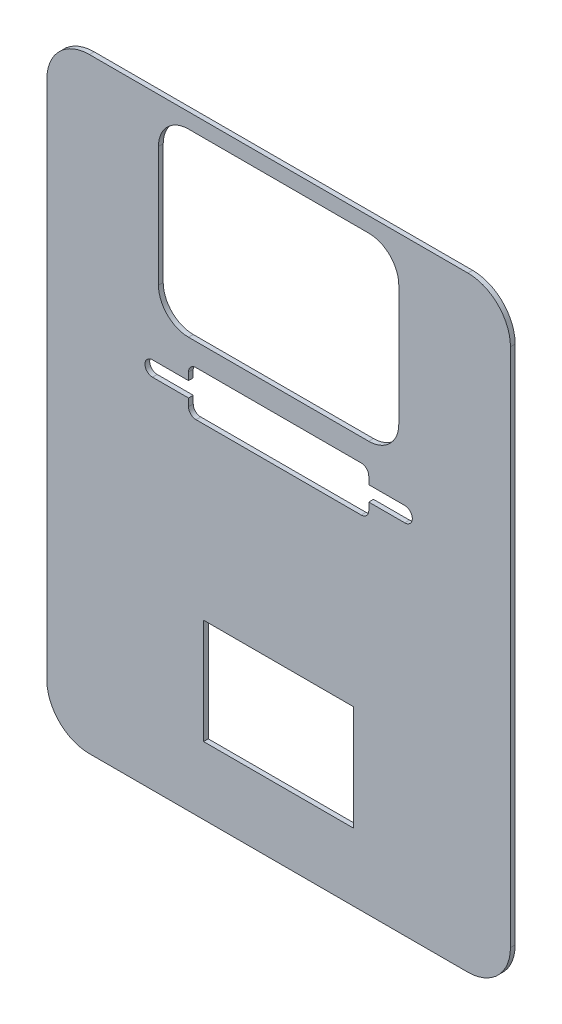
ISO-10303-21;
HEADER;
FILE_DESCRIPTION(('STEP AP214'),'2;1');
FILE_NAME('part.step','',(''),(''),'','','');
FILE_SCHEMA(('AUTOMOTIVE_DESIGN { 1 0 10303 214 1 1 1 1 }'));
ENDSEC;
DATA;
#1=APPLICATION_CONTEXT('core data for automotive mechanical design processes');
#2=APPLICATION_PROTOCOL_DEFINITION('international standard','automotive_design',2000,#1);
#3=PRODUCT_CONTEXT('',#1,'mechanical');
#4=PRODUCT('Part','Part','',(#3));
#5=PRODUCT_RELATED_PRODUCT_CATEGORY('part','',(#4));
#6=PRODUCT_DEFINITION_FORMATION('','',#4);
#7=PRODUCT_DEFINITION_CONTEXT('part definition',#1,'design');
#8=PRODUCT_DEFINITION('design','',#6,#7);
#9=PRODUCT_DEFINITION_SHAPE('','',#8);
#10=(LENGTH_UNIT() NAMED_UNIT(*) SI_UNIT(.MILLI.,.METRE.));
#11=(NAMED_UNIT(*) PLANE_ANGLE_UNIT() SI_UNIT($,.RADIAN.));
#12=(NAMED_UNIT(*) SI_UNIT($,.STERADIAN.) SOLID_ANGLE_UNIT());
#13=UNCERTAINTY_MEASURE_WITH_UNIT(LENGTH_MEASURE(1.E-05),#10,'distance_accuracy_value','');
#14=(GEOMETRIC_REPRESENTATION_CONTEXT(3) GLOBAL_UNCERTAINTY_ASSIGNED_CONTEXT((#13)) GLOBAL_UNIT_ASSIGNED_CONTEXT((#10,
#11,#12)) REPRESENTATION_CONTEXT('',''));
#15=CARTESIAN_POINT('',(0.,0.,0.));
#16=DIRECTION('',(0.,0.,1.));
#17=DIRECTION('',(1.,0.,0.));
#18=AXIS2_PLACEMENT_3D('',#15,#16,#17);
#19=CARTESIAN_POINT('',(-74.,0.,-0.5));
#20=DIRECTION('',(0.,0.,-1.));
#21=DIRECTION('',(-1.,0.,0.));
#22=AXIS2_PLACEMENT_3D('',#19,#20,#21);
#23=PLANE('',#22);
#24=DIRECTION('',(1.,0.,0.));
#25=VECTOR('',#24,1.);
#26=CARTESIAN_POINT('',(53.525,47.0992649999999,-0.5));
#27=LINE('',#26,#25);
#28=CARTESIAN_POINT('',(53.525,47.0992649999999,-0.5));
#29=VERTEX_POINT('',#28);
#30=CARTESIAN_POINT('',(57.3357445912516,47.0992649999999,-0.5));
#31=VERTEX_POINT('',#30);
#32=EDGE_CURVE('E281',#29,#31,#27,.T.);
#33=ORIENTED_EDGE('',*,*,#32,.T.);
#34=CARTESIAN_POINT('',(57.3357445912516,47.8930149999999,-0.5));
#35=DIRECTION('',(0.,0.,-1.));
#36=DIRECTION('',(-1.,0.,0.));
#37=AXIS2_PLACEMENT_3D('',#34,#35,#36);
#38=CIRCLE('',#37,0.79375000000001);
#39=CARTESIAN_POINT('',(57.3357445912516,48.6867649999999,-0.5));
#40=VERTEX_POINT('',#39);
#41=EDGE_CURVE('E268',#31,#40,#38,.F.);
#42=ORIENTED_EDGE('',*,*,#41,.T.);
#43=DIRECTION('',(-1.,0.,0.));
#44=VECTOR('',#43,1.);
#45=CARTESIAN_POINT('',(53.525,48.6867649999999,-0.5));
#46=LINE('',#45,#44);
#47=CARTESIAN_POINT('',(53.525,48.6867649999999,-0.5));
#48=VERTEX_POINT('',#47);
#49=EDGE_CURVE('E525',#40,#48,#46,.T.);
#50=ORIENTED_EDGE('',*,*,#49,.T.);
#51=DIRECTION('',(0.,1.,0.));
#52=VECTOR('',#51,1.);
#53=CARTESIAN_POINT('',(53.525,48.6867649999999,-0.5));
#54=LINE('',#53,#52);
#55=CARTESIAN_POINT('',(53.525,49.4805149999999,-0.5));
#56=VERTEX_POINT('',#55);
#57=EDGE_CURVE('E522',#48,#56,#54,.T.);
#58=ORIENTED_EDGE('',*,*,#57,.T.);
#59=CARTESIAN_POINT('',(52.73125,49.4805149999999,-0.5));
#60=DIRECTION('',(0.,0.,-1.));
#61=DIRECTION('',(-1.,0.,0.));
#62=AXIS2_PLACEMENT_3D('',#59,#60,#61);
#63=CIRCLE('',#62,0.793750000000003);
#64=CARTESIAN_POINT('',(52.73125,50.2742649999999,-0.5));
#65=VERTEX_POINT('',#64);
#66=EDGE_CURVE('E484',#56,#65,#63,.F.);
#67=ORIENTED_EDGE('',*,*,#66,.T.);
#68=DIRECTION('',(-1.,0.,0.));
#69=VECTOR('',#68,1.);
#70=CARTESIAN_POINT('',(35.26875,50.2742649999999,-0.5));
#71=LINE('',#70,#69);
#72=CARTESIAN_POINT('',(35.26875,50.2742649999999,-0.5));
#73=VERTEX_POINT('',#72);
#74=EDGE_CURVE('E479',#65,#73,#71,.T.);
#75=ORIENTED_EDGE('',*,*,#74,.T.);
#76=CARTESIAN_POINT('',(35.26875,49.4805149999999,-0.5));
#77=DIRECTION('',(0.,0.,-1.));
#78=DIRECTION('',(-1.,0.,0.));
#79=AXIS2_PLACEMENT_3D('',#76,#77,#78);
#80=CIRCLE('',#79,0.793750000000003);
#81=CARTESIAN_POINT('',(34.475,49.4805149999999,-0.5));
#82=VERTEX_POINT('',#81);
#83=EDGE_CURVE('E483',#73,#82,#80,.F.);
#84=ORIENTED_EDGE('',*,*,#83,.T.);
#85=DIRECTION('',(0.,-1.,0.));
#86=VECTOR('',#85,1.);
#87=CARTESIAN_POINT('',(34.475,48.6867649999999,-0.5));
#88=LINE('',#87,#86);
#89=CARTESIAN_POINT('',(34.475,48.6867649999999,-0.5));
#90=VERTEX_POINT('',#89);
#91=EDGE_CURVE('E437',#82,#90,#88,.T.);
#92=ORIENTED_EDGE('',*,*,#91,.T.);
#93=DIRECTION('',(-1.,0.,0.));
#94=VECTOR('',#93,1.);
#95=CARTESIAN_POINT('',(34.475,48.6867649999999,-0.5));
#96=LINE('',#95,#94);
#97=CARTESIAN_POINT('',(30.6642554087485,48.6867649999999,-0.5));
#98=VERTEX_POINT('',#97);
#99=EDGE_CURVE('E433',#90,#98,#96,.T.);
#100=ORIENTED_EDGE('',*,*,#99,.T.);
#101=CARTESIAN_POINT('',(30.6642554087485,47.8930149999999,-0.5));
#102=DIRECTION('',(0.,0.,-1.));
#103=DIRECTION('',(-1.,0.,0.));
#104=AXIS2_PLACEMENT_3D('',#101,#102,#103);
#105=CIRCLE('',#104,0.79375000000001);
#106=CARTESIAN_POINT('',(30.6642554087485,47.0992649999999,-0.5));
#107=VERTEX_POINT('',#106);
#108=EDGE_CURVE('E436',#98,#107,#105,.F.);
#109=ORIENTED_EDGE('',*,*,#108,.T.);
#110=DIRECTION('',(1.,0.,0.));
#111=VECTOR('',#110,1.);
#112=CARTESIAN_POINT('',(34.475,47.0992649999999,-0.5));
#113=LINE('',#112,#111);
#114=CARTESIAN_POINT('',(34.475,47.0992649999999,-0.5));
#115=VERTEX_POINT('',#114);
#116=EDGE_CURVE('E402',#107,#115,#113,.T.);
#117=ORIENTED_EDGE('',*,*,#116,.T.);
#118=DIRECTION('',(0.,-1.,0.));
#119=VECTOR('',#118,1.);
#120=CARTESIAN_POINT('',(34.475,46.3055149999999,-0.5));
#121=LINE('',#120,#119);
#122=CARTESIAN_POINT('',(34.475,46.3055149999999,-0.5));
#123=VERTEX_POINT('',#122);
#124=EDGE_CURVE('E399',#115,#123,#121,.T.);
#125=ORIENTED_EDGE('',*,*,#124,.T.);
#126=CARTESIAN_POINT('',(35.26875,46.3055149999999,-0.5));
#127=DIRECTION('',(0.,0.,-1.));
#128=DIRECTION('',(-1.,0.,0.));
#129=AXIS2_PLACEMENT_3D('',#126,#127,#128);
#130=CIRCLE('',#129,0.793750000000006);
#131=CARTESIAN_POINT('',(35.26875,45.5117649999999,-0.5));
#132=VERTEX_POINT('',#131);
#133=EDGE_CURVE('E360',#123,#132,#130,.F.);
#134=ORIENTED_EDGE('',*,*,#133,.T.);
#135=DIRECTION('',(1.,0.,0.));
#136=VECTOR('',#135,1.);
#137=CARTESIAN_POINT('',(35.26875,45.5117649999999,-0.5));
#138=LINE('',#137,#136);
#139=CARTESIAN_POINT('',(52.73125,45.5117649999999,-0.5));
#140=VERTEX_POINT('',#139);
#141=EDGE_CURVE('E356',#132,#140,#138,.T.);
#142=ORIENTED_EDGE('',*,*,#141,.T.);
#143=CARTESIAN_POINT('',(52.73125,46.3055149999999,-0.5));
#144=DIRECTION('',(0.,0.,-1.));
#145=DIRECTION('',(-1.,0.,0.));
#146=AXIS2_PLACEMENT_3D('',#143,#144,#145);
#147=CIRCLE('',#146,0.793750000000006);
#148=CARTESIAN_POINT('',(53.525,46.3055149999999,-0.5));
#149=VERTEX_POINT('',#148);
#150=EDGE_CURVE('E294',#140,#149,#147,.F.);
#151=ORIENTED_EDGE('',*,*,#150,.T.);
#152=DIRECTION('',(0.,1.,0.));
#153=VECTOR('',#152,1.);
#154=CARTESIAN_POINT('',(53.525,46.3055149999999,-0.5));
#155=LINE('',#154,#153);
#156=EDGE_CURVE('E290',#149,#29,#155,.T.);
#157=ORIENTED_EDGE('',*,*,#156,.T.);
#158=EDGE_LOOP('',(#33,#42,#50,#58,#67,#75,#84,#92,#100,#109,#117,#125,#134,#142,#151,#157));
#159=FACE_BOUND('',#158,.T.);
#160=DIRECTION('',(0.,1.,0.));
#161=VECTOR('',#160,1.);
#162=CARTESIAN_POINT('',(51.9375,16.4437499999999,-0.5));
#163=LINE('',#162,#161);
#164=CARTESIAN_POINT('',(51.9375,16.4437499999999,-0.5));
#165=VERTEX_POINT('',#164);
#166=CARTESIAN_POINT('',(51.9375,27.5562499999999,-0.5));
#167=VERTEX_POINT('',#166);
#168=EDGE_CURVE('E732',#165,#167,#163,.T.);
#169=ORIENTED_EDGE('',*,*,#168,.T.);
#170=DIRECTION('',(-1.,0.,0.));
#171=VECTOR('',#170,1.);
#172=CARTESIAN_POINT('',(36.0625,27.5562499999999,-0.5));
#173=LINE('',#172,#171);
#174=CARTESIAN_POINT('',(36.0625,27.5562499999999,-0.5));
#175=VERTEX_POINT('',#174);
#176=EDGE_CURVE('E555',#167,#175,#173,.T.);
#177=ORIENTED_EDGE('',*,*,#176,.T.);
#178=DIRECTION('',(0.,-1.,0.));
#179=VECTOR('',#178,1.);
#180=CARTESIAN_POINT('',(36.0625,16.4437499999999,-0.5));
#181=LINE('',#180,#179);
#182=CARTESIAN_POINT('',(36.0625,16.4437499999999,-0.5));
#183=VERTEX_POINT('',#182);
#184=EDGE_CURVE('E775',#175,#183,#181,.T.);
#185=ORIENTED_EDGE('',*,*,#184,.T.);
#186=DIRECTION('',(1.,0.,0.));
#187=VECTOR('',#186,1.);
#188=CARTESIAN_POINT('',(36.0625,16.4437499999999,-0.5));
#189=LINE('',#188,#187);
#190=EDGE_CURVE('E772',#183,#165,#189,.T.);
#191=ORIENTED_EDGE('',*,*,#190,.T.);
#192=EDGE_LOOP('',(#169,#177,#185,#191));
#193=FACE_BOUND('',#192,.T.);
#194=CARTESIAN_POINT('',(34.475,55.8368649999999,-0.5));
#195=DIRECTION('',(0.,0.,-1.));
#196=DIRECTION('',(-1.,0.,0.));
#197=AXIS2_PLACEMENT_3D('',#194,#195,#196);
#198=CIRCLE('',#197,3.175);
#199=CARTESIAN_POINT('',(31.3,55.8368649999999,-0.5));
#200=VERTEX_POINT('',#199);
#201=CARTESIAN_POINT('',(34.475,52.6618649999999,-0.5));
#202=VERTEX_POINT('',#201);
#203=EDGE_CURVE('E1620',#200,#202,#198,.F.);
#204=ORIENTED_EDGE('',*,*,#203,.T.);
#205=DIRECTION('',(1.,0.,0.));
#206=VECTOR('',#205,1.);
#207=CARTESIAN_POINT('',(34.475,52.6618649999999,-0.5));
#208=LINE('',#207,#206);
#209=CARTESIAN_POINT('',(53.525,52.6618649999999,-0.5));
#210=VERTEX_POINT('',#209);
#211=EDGE_CURVE('E1127',#202,#210,#208,.T.);
#212=ORIENTED_EDGE('',*,*,#211,.T.);
#213=CARTESIAN_POINT('',(53.525,55.8368649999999,-0.5));
#214=DIRECTION('',(0.,0.,-1.));
#215=DIRECTION('',(-1.,0.,0.));
#216=AXIS2_PLACEMENT_3D('',#213,#214,#215);
#217=CIRCLE('',#216,3.175);
#218=CARTESIAN_POINT('',(56.7,55.8368649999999,-0.5));
#219=VERTEX_POINT('',#218);
#220=EDGE_CURVE('E276',#210,#219,#217,.F.);
#221=ORIENTED_EDGE('',*,*,#220,.T.);
#222=DIRECTION('',(0.,1.,0.));
#223=VECTOR('',#222,1.);
#224=CARTESIAN_POINT('',(56.7,55.8368649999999,-0.5));
#225=LINE('',#224,#223);
#226=CARTESIAN_POINT('',(56.7,68.5368649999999,-0.5));
#227=VERTEX_POINT('',#226);
#228=EDGE_CURVE('E1719',#219,#227,#225,.T.);
#229=ORIENTED_EDGE('',*,*,#228,.T.);
#230=CARTESIAN_POINT('',(53.525,68.5368649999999,-0.5));
#231=DIRECTION('',(0.,0.,-1.));
#232=DIRECTION('',(-1.,0.,0.));
#233=AXIS2_PLACEMENT_3D('',#230,#231,#232);
#234=CIRCLE('',#233,3.175);
#235=CARTESIAN_POINT('',(53.525,71.7118649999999,-0.5));
#236=VERTEX_POINT('',#235);
#237=EDGE_CURVE('E1692',#227,#236,#234,.F.);
#238=ORIENTED_EDGE('',*,*,#237,.T.);
#239=DIRECTION('',(-1.,0.,0.));
#240=VECTOR('',#239,1.);
#241=CARTESIAN_POINT('',(34.475,71.7118649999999,-0.5));
#242=LINE('',#241,#240);
#243=CARTESIAN_POINT('',(34.475,71.7118649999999,-0.5));
#244=VERTEX_POINT('',#243);
#245=EDGE_CURVE('E1688',#236,#244,#242,.T.);
#246=ORIENTED_EDGE('',*,*,#245,.T.);
#247=CARTESIAN_POINT('',(34.475,68.5368649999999,-0.5));
#248=DIRECTION('',(0.,0.,-1.));
#249=DIRECTION('',(-1.,0.,0.));
#250=AXIS2_PLACEMENT_3D('',#247,#248,#249);
#251=CIRCLE('',#250,3.17499999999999);
#252=CARTESIAN_POINT('',(31.3,68.5368649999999,-0.5));
#253=VERTEX_POINT('',#252);
#254=EDGE_CURVE('E1662',#244,#253,#251,.F.);
#255=ORIENTED_EDGE('',*,*,#254,.T.);
#256=DIRECTION('',(0.,-1.,0.));
#257=VECTOR('',#256,1.);
#258=CARTESIAN_POINT('',(31.3,55.8368649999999,-0.5));
#259=LINE('',#258,#257);
#260=EDGE_CURVE('E1658',#253,#200,#259,.T.);
#261=ORIENTED_EDGE('',*,*,#260,.T.);
#262=EDGE_LOOP('',(#204,#212,#221,#229,#238,#246,#255,#261));
#263=FACE_BOUND('',#262,.T.);
#264=CARTESIAN_POINT('',(64.,13.7999999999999,-0.5));
#265=DIRECTION('',(0.,0.,-1.));
#266=DIRECTION('',(-1.,0.,0.));
#267=AXIS2_PLACEMENT_3D('',#264,#265,#266);
#268=CIRCLE('',#267,4.5);
#269=CARTESIAN_POINT('',(64.,9.29999999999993,-0.5));
#270=VERTEX_POINT('',#269);
#271=CARTESIAN_POINT('',(68.5,13.8,-0.5));
#272=VERTEX_POINT('',#271);
#273=EDGE_CURVE('E45',#270,#272,#268,.F.);
#274=ORIENTED_EDGE('',*,*,#273,.F.);
#275=DIRECTION('',(1.,0.,0.));
#276=VECTOR('',#275,1.);
#277=CARTESIAN_POINT('',(24.,9.29999999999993,-0.5));
#278=LINE('',#277,#276);
#279=CARTESIAN_POINT('',(24.,9.29999999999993,-0.5));
#280=VERTEX_POINT('',#279);
#281=EDGE_CURVE('E820',#280,#270,#278,.T.);
#282=ORIENTED_EDGE('',*,*,#281,.F.);
#283=CARTESIAN_POINT('',(24.,13.7999999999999,-0.5));
#284=DIRECTION('',(0.,0.,-1.));
#285=DIRECTION('',(-1.,0.,0.));
#286=AXIS2_PLACEMENT_3D('',#283,#284,#285);
#287=CIRCLE('',#286,4.5);
#288=CARTESIAN_POINT('',(19.5,13.8,-0.5));
#289=VERTEX_POINT('',#288);
#290=EDGE_CURVE('E879',#289,#280,#287,.F.);
#291=ORIENTED_EDGE('',*,*,#290,.F.);
#292=DIRECTION('',(0.,-1.,0.));
#293=VECTOR('',#292,1.);
#294=CARTESIAN_POINT('',(19.5,68.7999999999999,-0.5));
#295=LINE('',#294,#293);
#296=CARTESIAN_POINT('',(19.5,68.7999999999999,-0.5));
#297=VERTEX_POINT('',#296);
#298=EDGE_CURVE('E910',#297,#289,#295,.T.);
#299=ORIENTED_EDGE('',*,*,#298,.F.);
#300=CARTESIAN_POINT('',(24.,68.7999999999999,-0.5));
#301=DIRECTION('',(0.,0.,-1.));
#302=DIRECTION('',(-1.,0.,0.));
#303=AXIS2_PLACEMENT_3D('',#300,#301,#302);
#304=CIRCLE('',#303,4.5);
#305=CARTESIAN_POINT('',(24.,73.2999999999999,-0.5));
#306=VERTEX_POINT('',#305);
#307=EDGE_CURVE('E953',#306,#297,#304,.F.);
#308=ORIENTED_EDGE('',*,*,#307,.F.);
#309=DIRECTION('',(-1.,0.,0.));
#310=VECTOR('',#309,1.);
#311=CARTESIAN_POINT('',(64.,73.2999999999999,-0.5));
#312=LINE('',#311,#310);
#313=CARTESIAN_POINT('',(64.,73.2999999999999,-0.5));
#314=VERTEX_POINT('',#313);
#315=EDGE_CURVE('E983',#314,#306,#312,.T.);
#316=ORIENTED_EDGE('',*,*,#315,.F.);
#317=CARTESIAN_POINT('',(64.,68.7999999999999,-0.5));
#318=DIRECTION('',(0.,0.,-1.));
#319=DIRECTION('',(-1.,0.,0.));
#320=AXIS2_PLACEMENT_3D('',#317,#318,#319);
#321=CIRCLE('',#320,4.5);
#322=CARTESIAN_POINT('',(68.5,68.7999999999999,-0.5));
#323=VERTEX_POINT('',#322);
#324=EDGE_CURVE('E821',#323,#314,#321,.F.);
#325=ORIENTED_EDGE('',*,*,#324,.F.);
#326=DIRECTION('',(0.,1.,0.));
#327=VECTOR('',#326,1.);
#328=CARTESIAN_POINT('',(68.5,13.8,-0.5));
#329=LINE('',#328,#327);
#330=EDGE_CURVE('E1052',#272,#323,#329,.T.);
#331=ORIENTED_EDGE('',*,*,#330,.F.);
#332=EDGE_LOOP('',(#274,#282,#291,#299,#308,#316,#325,#331));
#333=FACE_BOUND('',#332,.T.);
#334=ADVANCED_FACE('F37',(#159,#193,#263,#333),#23,.T.);
#335=CARTESIAN_POINT('',(64.,13.7999999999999,0.));
#336=DIRECTION('',(0.,0.,1.));
#337=DIRECTION('',(1.,0.,0.));
#338=AXIS2_PLACEMENT_3D('',#335,#336,#337);
#339=PLANE('',#338);
#340=DIRECTION('',(1.,0.,0.));
#341=VECTOR('',#340,1.);
#342=CARTESIAN_POINT('',(53.525,47.0992649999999,0.));
#343=LINE('',#342,#341);
#344=CARTESIAN_POINT('',(53.525,47.0992649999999,0.));
#345=VERTEX_POINT('',#344);
#346=CARTESIAN_POINT('',(57.3357445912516,47.0992649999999,0.));
#347=VERTEX_POINT('',#346);
#348=EDGE_CURVE('E284',#345,#347,#343,.T.);
#349=ORIENTED_EDGE('',*,*,#348,.F.);
#350=DIRECTION('',(0.,1.,0.));
#351=VECTOR('',#350,1.);
#352=CARTESIAN_POINT('',(53.525,46.3055149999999,0.));
#353=LINE('',#352,#351);
#354=CARTESIAN_POINT('',(53.525,46.3055149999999,0.));
#355=VERTEX_POINT('',#354);
#356=EDGE_CURVE('E285',#355,#345,#353,.T.);
#357=ORIENTED_EDGE('',*,*,#356,.F.);
#358=CARTESIAN_POINT('',(52.73125,46.3055149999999,0.));
#359=DIRECTION('',(0.,0.,1.));
#360=DIRECTION('',(1.,0.,0.));
#361=AXIS2_PLACEMENT_3D('',#358,#359,#360);
#362=CIRCLE('',#361,0.793750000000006);
#363=CARTESIAN_POINT('',(52.73125,45.5117649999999,0.));
#364=VERTEX_POINT('',#363);
#365=EDGE_CURVE('E2080',#364,#355,#362,.T.);
#366=ORIENTED_EDGE('',*,*,#365,.F.);
#367=DIRECTION('',(1.,0.,0.));
#368=VECTOR('',#367,1.);
#369=CARTESIAN_POINT('',(35.26875,45.5117649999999,0.));
#370=LINE('',#369,#368);
#371=CARTESIAN_POINT('',(35.26875,45.5117649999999,0.));
#372=VERTEX_POINT('',#371);
#373=EDGE_CURVE('E2083',#372,#364,#370,.T.);
#374=ORIENTED_EDGE('',*,*,#373,.F.);
#375=CARTESIAN_POINT('',(35.26875,46.3055149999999,0.));
#376=DIRECTION('',(0.,0.,1.));
#377=DIRECTION('',(-1.,0.,0.));
#378=AXIS2_PLACEMENT_3D('',#375,#376,#377);
#379=CIRCLE('',#378,0.793750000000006);
#380=CARTESIAN_POINT('',(34.475,46.3055149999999,0.));
#381=VERTEX_POINT('',#380);
#382=EDGE_CURVE('E2135',#381,#372,#379,.T.);
#383=ORIENTED_EDGE('',*,*,#382,.F.);
#384=DIRECTION('',(0.,-1.,0.));
#385=VECTOR('',#384,1.);
#386=CARTESIAN_POINT('',(34.475,46.3055149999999,0.));
#387=LINE('',#386,#385);
#388=CARTESIAN_POINT('',(34.475,47.0992649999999,0.));
#389=VERTEX_POINT('',#388);
#390=EDGE_CURVE('E2138',#389,#381,#387,.T.);
#391=ORIENTED_EDGE('',*,*,#390,.F.);
#392=DIRECTION('',(1.,0.,0.));
#393=VECTOR('',#392,1.);
#394=CARTESIAN_POINT('',(34.475,47.0992649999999,0.));
#395=LINE('',#394,#393);
#396=CARTESIAN_POINT('',(30.6642554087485,47.0992649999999,0.));
#397=VERTEX_POINT('',#396);
#398=EDGE_CURVE('E2179',#397,#389,#395,.T.);
#399=ORIENTED_EDGE('',*,*,#398,.F.);
#400=CARTESIAN_POINT('',(30.6642554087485,47.8930149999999,0.));
#401=DIRECTION('',(0.,0.,1.));
#402=DIRECTION('',(-1.,0.,0.));
#403=AXIS2_PLACEMENT_3D('',#400,#401,#402);
#404=CIRCLE('',#403,0.79375000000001);
#405=CARTESIAN_POINT('',(30.6642554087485,48.6867649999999,0.));
#406=VERTEX_POINT('',#405);
#407=EDGE_CURVE('E2182',#406,#397,#404,.T.);
#408=ORIENTED_EDGE('',*,*,#407,.F.);
#409=DIRECTION('',(-1.,0.,0.));
#410=VECTOR('',#409,1.);
#411=CARTESIAN_POINT('',(34.475,48.6867649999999,0.));
#412=LINE('',#411,#410);
#413=CARTESIAN_POINT('',(34.475,48.6867649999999,0.));
#414=VERTEX_POINT('',#413);
#415=EDGE_CURVE('E2223',#414,#406,#412,.T.);
#416=ORIENTED_EDGE('',*,*,#415,.F.);
#417=DIRECTION('',(0.,-1.,0.));
#418=VECTOR('',#417,1.);
#419=CARTESIAN_POINT('',(34.475,48.6867649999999,0.));
#420=LINE('',#419,#418);
#421=CARTESIAN_POINT('',(34.475,49.4805149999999,0.));
#422=VERTEX_POINT('',#421);
#423=EDGE_CURVE('E2226',#422,#414,#420,.T.);
#424=ORIENTED_EDGE('',*,*,#423,.F.);
#425=CARTESIAN_POINT('',(35.26875,49.4805149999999,0.));
#426=DIRECTION('',(0.,0.,1.));
#427=DIRECTION('',(-1.,0.,0.));
#428=AXIS2_PLACEMENT_3D('',#425,#426,#427);
#429=CIRCLE('',#428,0.793750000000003);
#430=CARTESIAN_POINT('',(35.26875,50.2742649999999,0.));
#431=VERTEX_POINT('',#430);
#432=EDGE_CURVE('E2267',#431,#422,#429,.T.);
#433=ORIENTED_EDGE('',*,*,#432,.F.);
#434=DIRECTION('',(-1.,0.,0.));
#435=VECTOR('',#434,1.);
#436=CARTESIAN_POINT('',(35.26875,50.2742649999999,0.));
#437=LINE('',#436,#435);
#438=CARTESIAN_POINT('',(52.73125,50.2742649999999,0.));
#439=VERTEX_POINT('',#438);
#440=EDGE_CURVE('E2270',#439,#431,#437,.T.);
#441=ORIENTED_EDGE('',*,*,#440,.F.);
#442=CARTESIAN_POINT('',(52.73125,49.4805149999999,0.));
#443=DIRECTION('',(0.,0.,1.));
#444=DIRECTION('',(-1.,0.,0.));
#445=AXIS2_PLACEMENT_3D('',#442,#443,#444);
#446=CIRCLE('',#445,0.793750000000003);
#447=CARTESIAN_POINT('',(53.525,49.4805149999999,0.));
#448=VERTEX_POINT('',#447);
#449=EDGE_CURVE('E2311',#448,#439,#446,.T.);
#450=ORIENTED_EDGE('',*,*,#449,.F.);
#451=DIRECTION('',(0.,1.,0.));
#452=VECTOR('',#451,1.);
#453=CARTESIAN_POINT('',(53.525,48.6867649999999,0.));
#454=LINE('',#453,#452);
#455=CARTESIAN_POINT('',(53.525,48.6867649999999,0.));
#456=VERTEX_POINT('',#455);
#457=EDGE_CURVE('E2314',#456,#448,#454,.T.);
#458=ORIENTED_EDGE('',*,*,#457,.F.);
#459=DIRECTION('',(-1.,0.,0.));
#460=VECTOR('',#459,1.);
#461=CARTESIAN_POINT('',(53.525,48.6867649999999,0.));
#462=LINE('',#461,#460);
#463=CARTESIAN_POINT('',(57.3357445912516,48.6867649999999,0.));
#464=VERTEX_POINT('',#463);
#465=EDGE_CURVE('E2352',#464,#456,#462,.T.);
#466=ORIENTED_EDGE('',*,*,#465,.F.);
#467=CARTESIAN_POINT('',(57.3357445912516,47.8930149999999,0.));
#468=DIRECTION('',(0.,0.,1.));
#469=DIRECTION('',(1.,0.,0.));
#470=AXIS2_PLACEMENT_3D('',#467,#468,#469);
#471=CIRCLE('',#470,0.79375000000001);
#472=EDGE_CURVE('E292',#347,#464,#471,.T.);
#473=ORIENTED_EDGE('',*,*,#472,.F.);
#474=EDGE_LOOP('',(#349,#357,#366,#374,#383,#391,#399,#408,#416,#424,#433,#441,#450,#458,#466,#473));
#475=FACE_BOUND('',#474,.T.);
#476=DIRECTION('',(0.,1.,0.));
#477=VECTOR('',#476,1.);
#478=CARTESIAN_POINT('',(51.9375,16.4437499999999,0.));
#479=LINE('',#478,#477);
#480=CARTESIAN_POINT('',(51.9375,16.4437499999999,0.));
#481=VERTEX_POINT('',#480);
#482=CARTESIAN_POINT('',(51.9375,27.5562499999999,0.));
#483=VERTEX_POINT('',#482);
#484=EDGE_CURVE('E730',#481,#483,#479,.T.);
#485=ORIENTED_EDGE('',*,*,#484,.F.);
#486=DIRECTION('',(1.,0.,0.));
#487=VECTOR('',#486,1.);
#488=CARTESIAN_POINT('',(36.0625,16.4437499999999,0.));
#489=LINE('',#488,#487);
#490=CARTESIAN_POINT('',(36.0625,16.4437499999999,0.));
#491=VERTEX_POINT('',#490);
#492=EDGE_CURVE('E605',#491,#481,#489,.T.);
#493=ORIENTED_EDGE('',*,*,#492,.F.);
#494=DIRECTION('',(0.,-1.,0.));
#495=VECTOR('',#494,1.);
#496=CARTESIAN_POINT('',(36.0625,16.4437499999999,0.));
#497=LINE('',#496,#495);
#498=CARTESIAN_POINT('',(36.0625,27.5562499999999,0.));
#499=VERTEX_POINT('',#498);
#500=EDGE_CURVE('E675',#499,#491,#497,.T.);
#501=ORIENTED_EDGE('',*,*,#500,.F.);
#502=DIRECTION('',(-1.,0.,0.));
#503=VECTOR('',#502,1.);
#504=CARTESIAN_POINT('',(36.0625,27.5562499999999,0.));
#505=LINE('',#504,#503);
#506=EDGE_CURVE('E678',#483,#499,#505,.T.);
#507=ORIENTED_EDGE('',*,*,#506,.F.);
#508=EDGE_LOOP('',(#485,#493,#501,#507));
#509=FACE_BOUND('',#508,.T.);
#510=CARTESIAN_POINT('',(34.475,55.8368649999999,0.));
#511=DIRECTION('',(0.,0.,1.));
#512=DIRECTION('',(-1.,0.,0.));
#513=AXIS2_PLACEMENT_3D('',#510,#511,#512);
#514=CIRCLE('',#513,3.175);
#515=CARTESIAN_POINT('',(31.3,55.8368649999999,0.));
#516=VERTEX_POINT('',#515);
#517=CARTESIAN_POINT('',(34.475,52.6618649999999,0.));
#518=VERTEX_POINT('',#517);
#519=EDGE_CURVE('E1617',#516,#518,#514,.T.);
#520=ORIENTED_EDGE('',*,*,#519,.F.);
#521=DIRECTION('',(0.,-1.,0.));
#522=VECTOR('',#521,1.);
#523=CARTESIAN_POINT('',(31.3,55.8368649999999,0.));
#524=LINE('',#523,#522);
#525=CARTESIAN_POINT('',(31.3,68.5368649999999,0.));
#526=VERTEX_POINT('',#525);
#527=EDGE_CURVE('E1292',#526,#516,#524,.T.);
#528=ORIENTED_EDGE('',*,*,#527,.F.);
#529=CARTESIAN_POINT('',(34.475,68.5368649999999,0.));
#530=DIRECTION('',(0.,0.,1.));
#531=DIRECTION('',(-1.,0.,0.));
#532=AXIS2_PLACEMENT_3D('',#529,#530,#531);
#533=CIRCLE('',#532,3.17499999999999);
#534=CARTESIAN_POINT('',(34.475,71.7118649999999,0.));
#535=VERTEX_POINT('',#534);
#536=EDGE_CURVE('E1474',#535,#526,#533,.T.);
#537=ORIENTED_EDGE('',*,*,#536,.F.);
#538=DIRECTION('',(-1.,0.,0.));
#539=VECTOR('',#538,1.);
#540=CARTESIAN_POINT('',(34.475,71.7118649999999,0.));
#541=LINE('',#540,#539);
#542=CARTESIAN_POINT('',(53.525,71.7118649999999,0.));
#543=VERTEX_POINT('',#542);
#544=EDGE_CURVE('E1477',#543,#535,#541,.T.);
#545=ORIENTED_EDGE('',*,*,#544,.F.);
#546=CARTESIAN_POINT('',(53.525,68.5368649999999,0.));
#547=DIRECTION('',(0.,0.,1.));
#548=DIRECTION('',(-1.,0.,0.));
#549=AXIS2_PLACEMENT_3D('',#546,#547,#548);
#550=CIRCLE('',#549,3.175);
#551=CARTESIAN_POINT('',(56.7,68.5368649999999,0.));
#552=VERTEX_POINT('',#551);
#553=EDGE_CURVE('E1529',#552,#543,#550,.T.);
#554=ORIENTED_EDGE('',*,*,#553,.F.);
#555=DIRECTION('',(0.,1.,0.));
#556=VECTOR('',#555,1.);
#557=CARTESIAN_POINT('',(56.7,55.8368649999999,0.));
#558=LINE('',#557,#556);
#559=CARTESIAN_POINT('',(56.7,55.8368649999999,0.));
#560=VERTEX_POINT('',#559);
#561=EDGE_CURVE('E1532',#560,#552,#558,.T.);
#562=ORIENTED_EDGE('',*,*,#561,.F.);
#563=CARTESIAN_POINT('',(53.525,55.8368649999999,0.));
#564=DIRECTION('',(0.,0.,1.));
#565=DIRECTION('',(1.,0.,0.));
#566=AXIS2_PLACEMENT_3D('',#563,#564,#565);
#567=CIRCLE('',#566,3.175);
#568=CARTESIAN_POINT('',(53.525,52.6618649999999,0.));
#569=VERTEX_POINT('',#568);
#570=EDGE_CURVE('E1573',#569,#560,#567,.T.);
#571=ORIENTED_EDGE('',*,*,#570,.F.);
#572=DIRECTION('',(1.,0.,0.));
#573=VECTOR('',#572,1.);
#574=CARTESIAN_POINT('',(34.475,52.6618649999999,0.));
#575=LINE('',#574,#573);
#576=EDGE_CURVE('E1576',#518,#569,#575,.T.);
#577=ORIENTED_EDGE('',*,*,#576,.F.);
#578=EDGE_LOOP('',(#520,#528,#537,#545,#554,#562,#571,#577));
#579=FACE_BOUND('',#578,.T.);
#580=CARTESIAN_POINT('',(64.,13.7999999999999,0.));
#581=DIRECTION('',(0.,0.,1.));
#582=DIRECTION('',(1.,0.,0.));
#583=AXIS2_PLACEMENT_3D('',#580,#581,#582);
#584=CIRCLE('',#583,4.5);
#585=CARTESIAN_POINT('',(64.,9.29999999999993,0.));
#586=VERTEX_POINT('',#585);
#587=CARTESIAN_POINT('',(68.5,13.8,0.));
#588=VERTEX_POINT('',#587);
#589=EDGE_CURVE('E1094',#586,#588,#584,.T.);
#590=ORIENTED_EDGE('',*,*,#589,.T.);
#591=DIRECTION('',(0.,1.,0.));
#592=VECTOR('',#591,1.);
#593=CARTESIAN_POINT('',(68.5,13.8,0.));
#594=LINE('',#593,#592);
#595=CARTESIAN_POINT('',(68.5,68.7999999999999,0.));
#596=VERTEX_POINT('',#595);
#597=EDGE_CURVE('E1245',#588,#596,#594,.T.);
#598=ORIENTED_EDGE('',*,*,#597,.T.);
#599=CARTESIAN_POINT('',(64.,68.7999999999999,0.));
#600=DIRECTION('',(0.,0.,1.));
#601=DIRECTION('',(1.,0.,0.));
#602=AXIS2_PLACEMENT_3D('',#599,#600,#601);
#603=CIRCLE('',#602,4.5);
#604=CARTESIAN_POINT('',(64.,73.2999999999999,0.));
#605=VERTEX_POINT('',#604);
#606=EDGE_CURVE('E1206',#596,#605,#603,.T.);
#607=ORIENTED_EDGE('',*,*,#606,.T.);
#608=DIRECTION('',(-1.,0.,0.));
#609=VECTOR('',#608,1.);
#610=CARTESIAN_POINT('',(64.,73.2999999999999,0.));
#611=LINE('',#610,#609);
#612=CARTESIAN_POINT('',(24.,73.2999999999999,0.));
#613=VERTEX_POINT('',#612);
#614=EDGE_CURVE('E1203',#605,#613,#611,.T.);
#615=ORIENTED_EDGE('',*,*,#614,.T.);
#616=CARTESIAN_POINT('',(24.,68.7999999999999,0.));
#617=DIRECTION('',(0.,0.,1.));
#618=DIRECTION('',(1.,0.,0.));
#619=AXIS2_PLACEMENT_3D('',#616,#617,#618);
#620=CIRCLE('',#619,4.5);
#621=CARTESIAN_POINT('',(19.5,68.7999999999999,0.));
#622=VERTEX_POINT('',#621);
#623=EDGE_CURVE('E1162',#613,#622,#620,.T.);
#624=ORIENTED_EDGE('',*,*,#623,.T.);
#625=DIRECTION('',(0.,-1.,0.));
#626=VECTOR('',#625,1.);
#627=CARTESIAN_POINT('',(19.5,68.7999999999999,0.));
#628=LINE('',#627,#626);
#629=CARTESIAN_POINT('',(19.5,13.8,0.));
#630=VERTEX_POINT('',#629);
#631=EDGE_CURVE('E1159',#622,#630,#628,.T.);
#632=ORIENTED_EDGE('',*,*,#631,.T.);
#633=CARTESIAN_POINT('',(24.,13.7999999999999,0.));
#634=DIRECTION('',(0.,0.,1.));
#635=DIRECTION('',(1.,0.,0.));
#636=AXIS2_PLACEMENT_3D('',#633,#634,#635);
#637=CIRCLE('',#636,4.5);
#638=CARTESIAN_POINT('',(24.,9.29999999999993,0.));
#639=VERTEX_POINT('',#638);
#640=EDGE_CURVE('E1126',#630,#639,#637,.T.);
#641=ORIENTED_EDGE('',*,*,#640,.T.);
#642=DIRECTION('',(1.,0.,0.));
#643=VECTOR('',#642,1.);
#644=CARTESIAN_POINT('',(24.,9.29999999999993,0.));
#645=LINE('',#644,#643);
#646=EDGE_CURVE('E1093',#639,#586,#645,.T.);
#647=ORIENTED_EDGE('',*,*,#646,.T.);
#648=EDGE_LOOP('',(#590,#598,#607,#615,#624,#632,#641,#647));
#649=FACE_BOUND('',#648,.T.);
#650=ADVANCED_FACE('F2447',(#475,#509,#579,#649),#339,.T.);
#651=CARTESIAN_POINT('',(68.5,13.8,-81.1039701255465));
#652=DIRECTION('',(1.,0.,0.));
#653=DIRECTION('',(0.,0.,-1.));
#654=AXIS2_PLACEMENT_3D('',#651,#652,#653);
#655=PLANE('',#654);
#656=DIRECTION('',(0.,0.,1.));
#657=VECTOR('',#656,1.);
#658=CARTESIAN_POINT('',(68.5,13.8,-81.1039701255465));
#659=LINE('',#658,#657);
#660=EDGE_CURVE('E12',#272,#588,#659,.T.);
#661=ORIENTED_EDGE('',*,*,#660,.F.);
#662=ORIENTED_EDGE('',*,*,#330,.T.);
#663=DIRECTION('',(0.,0.,1.));
#664=VECTOR('',#663,1.);
#665=CARTESIAN_POINT('',(68.5,68.7999999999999,-81.1039701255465));
#666=LINE('',#665,#664);
#667=EDGE_CURVE('E1050',#323,#596,#666,.T.);
#668=ORIENTED_EDGE('',*,*,#667,.T.);
#669=ORIENTED_EDGE('',*,*,#597,.F.);
#670=EDGE_LOOP('',(#661,#662,#668,#669));
#671=FACE_BOUND('',#670,.T.);
#672=ADVANCED_FACE('F2528',(#671),#655,.T.);
#673=CARTESIAN_POINT('',(64.,68.7999999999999,-81.1039701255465));
#674=DIRECTION('',(0.,0.,1.));
#675=DIRECTION('',(1.,0.,0.));
#676=AXIS2_PLACEMENT_3D('',#673,#674,#675);
#677=CYLINDRICAL_SURFACE('',#676,4.5);
#678=ORIENTED_EDGE('',*,*,#667,.F.);
#679=ORIENTED_EDGE('',*,*,#324,.T.);
#680=DIRECTION('',(0.,0.,1.));
#681=VECTOR('',#680,1.);
#682=CARTESIAN_POINT('',(64.,73.2999999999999,-81.1039701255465));
#683=LINE('',#682,#681);
#684=EDGE_CURVE('E984',#314,#605,#683,.T.);
#685=ORIENTED_EDGE('',*,*,#684,.T.);
#686=ORIENTED_EDGE('',*,*,#606,.F.);
#687=EDGE_LOOP('',(#678,#679,#685,#686));
#688=FACE_BOUND('',#687,.T.);
#689=ADVANCED_FACE('F2533',(#688),#677,.T.);
#690=CARTESIAN_POINT('',(64.,73.2999999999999,-81.1039701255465));
#691=DIRECTION('',(0.,1.,0.));
#692=DIRECTION('',(0.,0.,1.));
#693=AXIS2_PLACEMENT_3D('',#690,#691,#692);
#694=PLANE('',#693);
#695=ORIENTED_EDGE('',*,*,#684,.F.);
#696=ORIENTED_EDGE('',*,*,#315,.T.);
#697=DIRECTION('',(0.,0.,1.));
#698=VECTOR('',#697,1.);
#699=CARTESIAN_POINT('',(24.,73.2999999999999,-81.1039701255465));
#700=LINE('',#699,#698);
#701=EDGE_CURVE('E980',#306,#613,#700,.T.);
#702=ORIENTED_EDGE('',*,*,#701,.T.);
#703=ORIENTED_EDGE('',*,*,#614,.F.);
#704=EDGE_LOOP('',(#695,#696,#702,#703));
#705=FACE_BOUND('',#704,.T.);
#706=ADVANCED_FACE('F2558',(#705),#694,.T.);
#707=CARTESIAN_POINT('',(24.,68.7999999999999,-81.1039701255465));
#708=DIRECTION('',(0.,0.,1.));
#709=DIRECTION('',(1.,0.,0.));
#710=AXIS2_PLACEMENT_3D('',#707,#708,#709);
#711=CYLINDRICAL_SURFACE('',#710,4.5);
#712=ORIENTED_EDGE('',*,*,#701,.F.);
#713=ORIENTED_EDGE('',*,*,#307,.T.);
#714=DIRECTION('',(0.,0.,1.));
#715=VECTOR('',#714,1.);
#716=CARTESIAN_POINT('',(19.5,68.7999999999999,-81.1039701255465));
#717=LINE('',#716,#715);
#718=EDGE_CURVE('E911',#297,#622,#717,.T.);
#719=ORIENTED_EDGE('',*,*,#718,.T.);
#720=ORIENTED_EDGE('',*,*,#623,.F.);
#721=EDGE_LOOP('',(#712,#713,#719,#720));
#722=FACE_BOUND('',#721,.T.);
#723=ADVANCED_FACE('F2554',(#722),#711,.T.);
#724=CARTESIAN_POINT('',(19.5,68.7999999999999,-81.1039701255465));
#725=DIRECTION('',(-1.,0.,0.));
#726=DIRECTION('',(0.,0.,1.));
#727=AXIS2_PLACEMENT_3D('',#724,#725,#726);
#728=PLANE('',#727);
#729=ORIENTED_EDGE('',*,*,#718,.F.);
#730=ORIENTED_EDGE('',*,*,#298,.T.);
#731=DIRECTION('',(0.,0.,1.));
#732=VECTOR('',#731,1.);
#733=CARTESIAN_POINT('',(19.5,13.8,-81.1039701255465));
#734=LINE('',#733,#732);
#735=EDGE_CURVE('E907',#289,#630,#734,.T.);
#736=ORIENTED_EDGE('',*,*,#735,.T.);
#737=ORIENTED_EDGE('',*,*,#631,.F.);
#738=EDGE_LOOP('',(#729,#730,#736,#737));
#739=FACE_BOUND('',#738,.T.);
#740=ADVANCED_FACE('F2550',(#739),#728,.T.);
#741=CARTESIAN_POINT('',(24.,13.7999999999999,-81.1039701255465));
#742=DIRECTION('',(0.,0.,1.));
#743=DIRECTION('',(1.,0.,0.));
#744=AXIS2_PLACEMENT_3D('',#741,#742,#743);
#745=CYLINDRICAL_SURFACE('',#744,4.5);
#746=ORIENTED_EDGE('',*,*,#735,.F.);
#747=ORIENTED_EDGE('',*,*,#290,.T.);
#748=DIRECTION('',(0.,0.,1.));
#749=VECTOR('',#748,1.);
#750=CARTESIAN_POINT('',(24.,9.29999999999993,-81.1039701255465));
#751=LINE('',#750,#749);
#752=EDGE_CURVE('E823',#280,#639,#751,.T.);
#753=ORIENTED_EDGE('',*,*,#752,.T.);
#754=ORIENTED_EDGE('',*,*,#640,.F.);
#755=EDGE_LOOP('',(#746,#747,#753,#754));
#756=FACE_BOUND('',#755,.T.);
#757=ADVANCED_FACE('F2546',(#756),#745,.T.);
#758=CARTESIAN_POINT('',(24.,9.29999999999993,-81.1039701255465));
#759=DIRECTION('',(0.,-1.,0.));
#760=DIRECTION('',(0.,0.,-1.));
#761=AXIS2_PLACEMENT_3D('',#758,#759,#760);
#762=PLANE('',#761);
#763=ORIENTED_EDGE('',*,*,#752,.F.);
#764=ORIENTED_EDGE('',*,*,#281,.T.);
#765=DIRECTION('',(0.,0.,1.));
#766=VECTOR('',#765,1.);
#767=CARTESIAN_POINT('',(64.,9.29999999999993,-81.1039701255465));
#768=LINE('',#767,#766);
#769=EDGE_CURVE('E816',#270,#586,#768,.T.);
#770=ORIENTED_EDGE('',*,*,#769,.T.);
#771=ORIENTED_EDGE('',*,*,#646,.F.);
#772=EDGE_LOOP('',(#763,#764,#770,#771));
#773=FACE_BOUND('',#772,.T.);
#774=ADVANCED_FACE('F2542',(#773),#762,.T.);
#775=CARTESIAN_POINT('',(64.,13.7999999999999,-81.1039701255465));
#776=DIRECTION('',(0.,0.,1.));
#777=DIRECTION('',(1.,0.,0.));
#778=AXIS2_PLACEMENT_3D('',#775,#776,#777);
#779=CYLINDRICAL_SURFACE('',#778,4.5);
#780=ORIENTED_EDGE('',*,*,#769,.F.);
#781=ORIENTED_EDGE('',*,*,#273,.T.);
#782=ORIENTED_EDGE('',*,*,#660,.T.);
#783=ORIENTED_EDGE('',*,*,#589,.F.);
#784=EDGE_LOOP('',(#780,#781,#782,#783));
#785=FACE_BOUND('',#784,.T.);
#786=ADVANCED_FACE('F2539',(#785),#779,.T.);
#787=CARTESIAN_POINT('',(34.475,55.8368649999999,-0.501));
#788=DIRECTION('',(0.,0.,1.));
#789=DIRECTION('',(1.,0.,0.));
#790=AXIS2_PLACEMENT_3D('',#787,#788,#789);
#791=CYLINDRICAL_SURFACE('',#790,3.175);
#792=DIRECTION('',(0.,0.,1.));
#793=VECTOR('',#792,1.);
#794=CARTESIAN_POINT('',(31.3,55.8368649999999,-0.501));
#795=LINE('',#794,#793);
#796=EDGE_CURVE('E1288',#200,#516,#795,.T.);
#797=ORIENTED_EDGE('',*,*,#796,.T.);
#798=ORIENTED_EDGE('',*,*,#519,.T.);
#799=DIRECTION('',(0.,0.,1.));
#800=VECTOR('',#799,1.);
#801=CARTESIAN_POINT('',(34.475,52.6618649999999,-0.501));
#802=LINE('',#801,#800);
#803=EDGE_CURVE('E1433',#202,#518,#802,.T.);
#804=ORIENTED_EDGE('',*,*,#803,.F.);
#805=ORIENTED_EDGE('',*,*,#203,.F.);
#806=EDGE_LOOP('',(#797,#798,#804,#805));
#807=FACE_BOUND('',#806,.T.);
#808=ADVANCED_FACE('F2537',(#807),#791,.F.);
#809=CARTESIAN_POINT('',(31.3,55.8368649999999,-0.501));
#810=DIRECTION('',(-1.,0.,0.));
#811=DIRECTION('',(0.,-1.,0.));
#812=AXIS2_PLACEMENT_3D('',#809,#810,#811);
#813=PLANE('',#812);
#814=DIRECTION('',(0.,0.,1.));
#815=VECTOR('',#814,1.);
#816=CARTESIAN_POINT('',(31.3,68.5368649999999,-0.501));
#817=LINE('',#816,#815);
#818=EDGE_CURVE('E1291',#253,#526,#817,.T.);
#819=ORIENTED_EDGE('',*,*,#818,.T.);
#820=ORIENTED_EDGE('',*,*,#527,.T.);
#821=ORIENTED_EDGE('',*,*,#796,.F.);
#822=ORIENTED_EDGE('',*,*,#260,.F.);
#823=EDGE_LOOP('',(#819,#820,#821,#822));
#824=FACE_BOUND('',#823,.T.);
#825=ADVANCED_FACE('F2610',(#824),#813,.F.);
#826=CARTESIAN_POINT('',(34.475,68.5368649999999,-0.501));
#827=DIRECTION('',(0.,0.,1.));
#828=DIRECTION('',(1.,0.,0.));
#829=AXIS2_PLACEMENT_3D('',#826,#827,#828);
#830=CYLINDRICAL_SURFACE('',#829,3.17499999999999);
#831=DIRECTION('',(0.,0.,1.));
#832=VECTOR('',#831,1.);
#833=CARTESIAN_POINT('',(34.475,71.7118649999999,-0.501));
#834=LINE('',#833,#832);
#835=EDGE_CURVE('E1346',#244,#535,#834,.T.);
#836=ORIENTED_EDGE('',*,*,#835,.T.);
#837=ORIENTED_EDGE('',*,*,#536,.T.);
#838=ORIENTED_EDGE('',*,*,#818,.F.);
#839=ORIENTED_EDGE('',*,*,#254,.F.);
#840=EDGE_LOOP('',(#836,#837,#838,#839));
#841=FACE_BOUND('',#840,.T.);
#842=ADVANCED_FACE('F2635',(#841),#830,.F.);
#843=CARTESIAN_POINT('',(34.475,71.7118649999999,-0.501));
#844=DIRECTION('',(0.,1.,0.));
#845=DIRECTION('',(0.,0.,1.));
#846=AXIS2_PLACEMENT_3D('',#843,#844,#845);
#847=PLANE('',#846);
#848=DIRECTION('',(0.,0.,1.));
#849=VECTOR('',#848,1.);
#850=CARTESIAN_POINT('',(53.525,71.7118649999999,-0.501));
#851=LINE('',#850,#849);
#852=EDGE_CURVE('E1348',#236,#543,#851,.T.);
#853=ORIENTED_EDGE('',*,*,#852,.T.);
#854=ORIENTED_EDGE('',*,*,#544,.T.);
#855=ORIENTED_EDGE('',*,*,#835,.F.);
#856=ORIENTED_EDGE('',*,*,#245,.F.);
#857=EDGE_LOOP('',(#853,#854,#855,#856));
#858=FACE_BOUND('',#857,.T.);
#859=ADVANCED_FACE('F2632',(#858),#847,.F.);
#860=CARTESIAN_POINT('',(53.525,68.5368649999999,-0.501));
#861=DIRECTION('',(0.,0.,1.));
#862=DIRECTION('',(1.,0.,0.));
#863=AXIS2_PLACEMENT_3D('',#860,#861,#862);
#864=CYLINDRICAL_SURFACE('',#863,3.175);
#865=DIRECTION('',(0.,0.,1.));
#866=VECTOR('',#865,1.);
#867=CARTESIAN_POINT('',(56.7,68.5368649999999,-0.501));
#868=LINE('',#867,#866);
#869=EDGE_CURVE('E1389',#227,#552,#868,.T.);
#870=ORIENTED_EDGE('',*,*,#869,.T.);
#871=ORIENTED_EDGE('',*,*,#553,.T.);
#872=ORIENTED_EDGE('',*,*,#852,.F.);
#873=ORIENTED_EDGE('',*,*,#237,.F.);
#874=EDGE_LOOP('',(#870,#871,#872,#873));
#875=FACE_BOUND('',#874,.T.);
#876=ADVANCED_FACE('F2628',(#875),#864,.F.);
#877=CARTESIAN_POINT('',(56.7,55.8368649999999,-0.501));
#878=DIRECTION('',(1.,0.,0.));
#879=DIRECTION('',(0.,0.,-1.));
#880=AXIS2_PLACEMENT_3D('',#877,#878,#879);
#881=PLANE('',#880);
#882=DIRECTION('',(0.,0.,1.));
#883=VECTOR('',#882,1.);
#884=CARTESIAN_POINT('',(56.7,55.8368649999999,-0.501));
#885=LINE('',#884,#883);
#886=EDGE_CURVE('E1391',#219,#560,#885,.T.);
#887=ORIENTED_EDGE('',*,*,#886,.T.);
#888=ORIENTED_EDGE('',*,*,#561,.T.);
#889=ORIENTED_EDGE('',*,*,#869,.F.);
#890=ORIENTED_EDGE('',*,*,#228,.F.);
#891=EDGE_LOOP('',(#887,#888,#889,#890));
#892=FACE_BOUND('',#891,.T.);
#893=ADVANCED_FACE('F2622',(#892),#881,.F.);
#894=CARTESIAN_POINT('',(53.525,55.8368649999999,-0.501));
#895=DIRECTION('',(0.,0.,1.));
#896=DIRECTION('',(1.,0.,0.));
#897=AXIS2_PLACEMENT_3D('',#894,#895,#896);
#898=CYLINDRICAL_SURFACE('',#897,3.175);
#899=DIRECTION('',(0.,0.,1.));
#900=VECTOR('',#899,1.);
#901=CARTESIAN_POINT('',(53.525,52.6618649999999,-0.501));
#902=LINE('',#901,#900);
#903=EDGE_CURVE('E1431',#210,#569,#902,.T.);
#904=ORIENTED_EDGE('',*,*,#903,.T.);
#905=ORIENTED_EDGE('',*,*,#570,.T.);
#906=ORIENTED_EDGE('',*,*,#886,.F.);
#907=ORIENTED_EDGE('',*,*,#220,.F.);
#908=EDGE_LOOP('',(#904,#905,#906,#907));
#909=FACE_BOUND('',#908,.T.);
#910=ADVANCED_FACE('F2620',(#909),#898,.F.);
#911=CARTESIAN_POINT('',(34.475,52.6618649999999,-0.501));
#912=DIRECTION('',(0.,-1.,0.));
#913=DIRECTION('',(0.,0.,-1.));
#914=AXIS2_PLACEMENT_3D('',#911,#912,#913);
#915=PLANE('',#914);
#916=ORIENTED_EDGE('',*,*,#803,.T.);
#917=ORIENTED_EDGE('',*,*,#576,.T.);
#918=ORIENTED_EDGE('',*,*,#903,.F.);
#919=ORIENTED_EDGE('',*,*,#211,.F.);
#920=EDGE_LOOP('',(#916,#917,#918,#919));
#921=FACE_BOUND('',#920,.T.);
#922=ADVANCED_FACE('F2601',(#921),#915,.F.);
#923=CARTESIAN_POINT('',(51.9375,16.4437499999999,-0.501));
#924=DIRECTION('',(1.,0.,0.));
#925=DIRECTION('',(0.,0.,-1.));
#926=AXIS2_PLACEMENT_3D('',#923,#924,#925);
#927=PLANE('',#926);
#928=DIRECTION('',(0.,0.,1.));
#929=VECTOR('',#928,1.);
#930=CARTESIAN_POINT('',(51.9375,16.4437499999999,-0.501));
#931=LINE('',#930,#929);
#932=EDGE_CURVE('E560',#165,#481,#931,.T.);
#933=ORIENTED_EDGE('',*,*,#932,.T.);
#934=ORIENTED_EDGE('',*,*,#484,.T.);
#935=DIRECTION('',(0.,0.,1.));
#936=VECTOR('',#935,1.);
#937=CARTESIAN_POINT('',(51.9375,27.5562499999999,-0.501));
#938=LINE('',#937,#936);
#939=EDGE_CURVE('E561',#167,#483,#938,.T.);
#940=ORIENTED_EDGE('',*,*,#939,.F.);
#941=ORIENTED_EDGE('',*,*,#168,.F.);
#942=EDGE_LOOP('',(#933,#934,#940,#941));
#943=FACE_BOUND('',#942,.T.);
#944=ADVANCED_FACE('F2652',(#943),#927,.F.);
#945=CARTESIAN_POINT('',(36.0625,16.4437499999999,-0.501));
#946=DIRECTION('',(0.,-1.,0.));
#947=DIRECTION('',(0.,0.,-1.));
#948=AXIS2_PLACEMENT_3D('',#945,#946,#947);
#949=PLANE('',#948);
#950=DIRECTION('',(0.,0.,1.));
#951=VECTOR('',#950,1.);
#952=CARTESIAN_POINT('',(36.0625,16.4437499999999,-0.501));
#953=LINE('',#952,#951);
#954=EDGE_CURVE('E604',#183,#491,#953,.T.);
#955=ORIENTED_EDGE('',*,*,#954,.T.);
#956=ORIENTED_EDGE('',*,*,#492,.T.);
#957=ORIENTED_EDGE('',*,*,#932,.F.);
#958=ORIENTED_EDGE('',*,*,#190,.F.);
#959=EDGE_LOOP('',(#955,#956,#957,#958));
#960=FACE_BOUND('',#959,.T.);
#961=ADVANCED_FACE('F2656',(#960),#949,.F.);
#962=CARTESIAN_POINT('',(36.0625,16.4437499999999,-0.501));
#963=DIRECTION('',(-1.,0.,0.));
#964=DIRECTION('',(0.,0.,1.));
#965=AXIS2_PLACEMENT_3D('',#962,#963,#964);
#966=PLANE('',#965);
#967=DIRECTION('',(0.,0.,1.));
#968=VECTOR('',#967,1.);
#969=CARTESIAN_POINT('',(36.0625,27.5562499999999,-0.501));
#970=LINE('',#969,#968);
#971=EDGE_CURVE('E60',#175,#499,#970,.T.);
#972=ORIENTED_EDGE('',*,*,#971,.T.);
#973=ORIENTED_EDGE('',*,*,#500,.T.);
#974=ORIENTED_EDGE('',*,*,#954,.F.);
#975=ORIENTED_EDGE('',*,*,#184,.F.);
#976=EDGE_LOOP('',(#972,#973,#974,#975));
#977=FACE_BOUND('',#976,.T.);
#978=ADVANCED_FACE('F2661',(#977),#966,.F.);
#979=CARTESIAN_POINT('',(36.0625,27.5562499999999,-0.501));
#980=DIRECTION('',(0.,1.,0.));
#981=DIRECTION('',(0.,0.,1.));
#982=AXIS2_PLACEMENT_3D('',#979,#980,#981);
#983=PLANE('',#982);
#984=ORIENTED_EDGE('',*,*,#939,.T.);
#985=ORIENTED_EDGE('',*,*,#506,.T.);
#986=ORIENTED_EDGE('',*,*,#971,.F.);
#987=ORIENTED_EDGE('',*,*,#176,.F.);
#988=EDGE_LOOP('',(#984,#985,#986,#987));
#989=FACE_BOUND('',#988,.T.);
#990=ADVANCED_FACE('F2522',(#989),#983,.F.);
#991=CARTESIAN_POINT('',(53.525,47.0992649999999,-0.501));
#992=DIRECTION('',(0.,-1.,0.));
#993=DIRECTION('',(1.,0.,0.));
#994=AXIS2_PLACEMENT_3D('',#991,#992,#993);
#995=PLANE('',#994);
#996=DIRECTION('',(0.,0.,1.));
#997=VECTOR('',#996,1.);
#998=CARTESIAN_POINT('',(53.525,47.0992649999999,-0.501));
#999=LINE('',#998,#997);
#1000=EDGE_CURVE('E277',#29,#345,#999,.T.);
#1001=ORIENTED_EDGE('',*,*,#1000,.T.);
#1002=ORIENTED_EDGE('',*,*,#348,.T.);
#1003=DIRECTION('',(0.,0.,1.));
#1004=VECTOR('',#1003,1.);
#1005=CARTESIAN_POINT('',(57.3357445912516,47.0992649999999,-0.501));
#1006=LINE('',#1005,#1004);
#1007=EDGE_CURVE('E271',#31,#347,#1006,.T.);
#1008=ORIENTED_EDGE('',*,*,#1007,.F.);
#1009=ORIENTED_EDGE('',*,*,#32,.F.);
#1010=EDGE_LOOP('',(#1001,#1002,#1008,#1009));
#1011=FACE_BOUND('',#1010,.T.);
#1012=ADVANCED_FACE('F280',(#1011),#995,.F.);
#1013=CARTESIAN_POINT('',(53.525,46.3055149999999,-0.501));
#1014=DIRECTION('',(1.,0.,0.));
#1015=DIRECTION('',(0.,0.,-1.));
#1016=AXIS2_PLACEMENT_3D('',#1013,#1014,#1015);
#1017=PLANE('',#1016);
#1018=DIRECTION('',(0.,0.,1.));
#1019=VECTOR('',#1018,1.);
#1020=CARTESIAN_POINT('',(53.525,46.3055149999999,-0.501));
#1021=LINE('',#1020,#1019);
#1022=EDGE_CURVE('E1750',#149,#355,#1021,.T.);
#1023=ORIENTED_EDGE('',*,*,#1022,.T.);
#1024=ORIENTED_EDGE('',*,*,#356,.T.);
#1025=ORIENTED_EDGE('',*,*,#1000,.F.);
#1026=ORIENTED_EDGE('',*,*,#156,.F.);
#1027=EDGE_LOOP('',(#1023,#1024,#1025,#1026));
#1028=FACE_BOUND('',#1027,.T.);
#1029=ADVANCED_FACE('F2514',(#1028),#1017,.F.);
#1030=CARTESIAN_POINT('',(52.73125,46.3055149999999,-0.501));
#1031=DIRECTION('',(0.,0.,1.));
#1032=DIRECTION('',(1.,0.,0.));
#1033=AXIS2_PLACEMENT_3D('',#1030,#1031,#1032);
#1034=CYLINDRICAL_SURFACE('',#1033,0.793750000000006);
#1035=DIRECTION('',(0.,0.,1.));
#1036=VECTOR('',#1035,1.);
#1037=CARTESIAN_POINT('',(52.73125,45.5117649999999,-0.501));
#1038=LINE('',#1037,#1036);
#1039=EDGE_CURVE('E1782',#140,#364,#1038,.T.);
#1040=ORIENTED_EDGE('',*,*,#1039,.T.);
#1041=ORIENTED_EDGE('',*,*,#365,.T.);
#1042=ORIENTED_EDGE('',*,*,#1022,.F.);
#1043=ORIENTED_EDGE('',*,*,#150,.F.);
#1044=EDGE_LOOP('',(#1040,#1041,#1042,#1043));
#1045=FACE_BOUND('',#1044,.T.);
#1046=ADVANCED_FACE('F2509',(#1045),#1034,.F.);
#1047=CARTESIAN_POINT('',(35.26875,45.5117649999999,-0.501));
#1048=DIRECTION('',(0.,-1.,0.));
#1049=DIRECTION('',(0.,0.,-1.));
#1050=AXIS2_PLACEMENT_3D('',#1047,#1048,#1049);
#1051=PLANE('',#1050);
#1052=DIRECTION('',(0.,0.,1.));
#1053=VECTOR('',#1052,1.);
#1054=CARTESIAN_POINT('',(35.26875,45.5117649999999,-0.501));
#1055=LINE('',#1054,#1053);
#1056=EDGE_CURVE('E1784',#132,#372,#1055,.T.);
#1057=ORIENTED_EDGE('',*,*,#1056,.T.);
#1058=ORIENTED_EDGE('',*,*,#373,.T.);
#1059=ORIENTED_EDGE('',*,*,#1039,.F.);
#1060=ORIENTED_EDGE('',*,*,#141,.F.);
#1061=EDGE_LOOP('',(#1057,#1058,#1059,#1060));
#1062=FACE_BOUND('',#1061,.T.);
#1063=ADVANCED_FACE('F2505',(#1062),#1051,.F.);
#1064=CARTESIAN_POINT('',(35.26875,46.3055149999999,-0.501));
#1065=DIRECTION('',(0.,0.,1.));
#1066=DIRECTION('',(1.,0.,0.));
#1067=AXIS2_PLACEMENT_3D('',#1064,#1065,#1066);
#1068=CYLINDRICAL_SURFACE('',#1067,0.793750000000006);
#1069=DIRECTION('',(0.,0.,1.));
#1070=VECTOR('',#1069,1.);
#1071=CARTESIAN_POINT('',(34.475,46.3055149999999,-0.501));
#1072=LINE('',#1071,#1070);
#1073=EDGE_CURVE('E1825',#123,#381,#1072,.T.);
#1074=ORIENTED_EDGE('',*,*,#1073,.T.);
#1075=ORIENTED_EDGE('',*,*,#382,.T.);
#1076=ORIENTED_EDGE('',*,*,#1056,.F.);
#1077=ORIENTED_EDGE('',*,*,#133,.F.);
#1078=EDGE_LOOP('',(#1074,#1075,#1076,#1077));
#1079=FACE_BOUND('',#1078,.T.);
#1080=ADVANCED_FACE('F2501',(#1079),#1068,.F.);
#1081=CARTESIAN_POINT('',(34.475,46.3055149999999,-0.501));
#1082=DIRECTION('',(-1.,0.,0.));
#1083=DIRECTION('',(0.,0.,1.));
#1084=AXIS2_PLACEMENT_3D('',#1081,#1082,#1083);
#1085=PLANE('',#1084);
#1086=DIRECTION('',(0.,0.,1.));
#1087=VECTOR('',#1086,1.);
#1088=CARTESIAN_POINT('',(34.475,47.0992649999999,-0.501));
#1089=LINE('',#1088,#1087);
#1090=EDGE_CURVE('E1827',#115,#389,#1089,.T.);
#1091=ORIENTED_EDGE('',*,*,#1090,.T.);
#1092=ORIENTED_EDGE('',*,*,#390,.T.);
#1093=ORIENTED_EDGE('',*,*,#1073,.F.);
#1094=ORIENTED_EDGE('',*,*,#124,.F.);
#1095=EDGE_LOOP('',(#1091,#1092,#1093,#1094));
#1096=FACE_BOUND('',#1095,.T.);
#1097=ADVANCED_FACE('F2495',(#1096),#1085,.F.);
#1098=CARTESIAN_POINT('',(34.475,47.0992649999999,-0.501));
#1099=DIRECTION('',(0.,-1.,0.));
#1100=DIRECTION('',(1.,0.,0.));
#1101=AXIS2_PLACEMENT_3D('',#1098,#1099,#1100);
#1102=PLANE('',#1101);
#1103=DIRECTION('',(0.,0.,1.));
#1104=VECTOR('',#1103,1.);
#1105=CARTESIAN_POINT('',(30.6642554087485,47.0992649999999,-0.501));
#1106=LINE('',#1105,#1104);
#1107=EDGE_CURVE('E1868',#107,#397,#1106,.T.);
#1108=ORIENTED_EDGE('',*,*,#1107,.T.);
#1109=ORIENTED_EDGE('',*,*,#398,.T.);
#1110=ORIENTED_EDGE('',*,*,#1090,.F.);
#1111=ORIENTED_EDGE('',*,*,#116,.F.);
#1112=EDGE_LOOP('',(#1108,#1109,#1110,#1111));
#1113=FACE_BOUND('',#1112,.T.);
#1114=ADVANCED_FACE('F2490',(#1113),#1102,.F.);
#1115=CARTESIAN_POINT('',(30.6642554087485,47.8930149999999,-0.501));
#1116=DIRECTION('',(0.,0.,1.));
#1117=DIRECTION('',(1.,0.,0.));
#1118=AXIS2_PLACEMENT_3D('',#1115,#1116,#1117);
#1119=CYLINDRICAL_SURFACE('',#1118,0.79375000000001);
#1120=DIRECTION('',(0.,0.,1.));
#1121=VECTOR('',#1120,1.);
#1122=CARTESIAN_POINT('',(30.6642554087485,48.6867649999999,-0.501));
#1123=LINE('',#1122,#1121);
#1124=EDGE_CURVE('E1870',#98,#406,#1123,.T.);
#1125=ORIENTED_EDGE('',*,*,#1124,.T.);
#1126=ORIENTED_EDGE('',*,*,#407,.T.);
#1127=ORIENTED_EDGE('',*,*,#1107,.F.);
#1128=ORIENTED_EDGE('',*,*,#108,.F.);
#1129=EDGE_LOOP('',(#1125,#1126,#1127,#1128));
#1130=FACE_BOUND('',#1129,.T.);
#1131=ADVANCED_FACE('F2486',(#1130),#1119,.F.);
#1132=CARTESIAN_POINT('',(34.475,48.6867649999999,-0.501));
#1133=DIRECTION('',(0.,1.,0.));
#1134=DIRECTION('',(-1.,0.,0.));
#1135=AXIS2_PLACEMENT_3D('',#1132,#1133,#1134);
#1136=PLANE('',#1135);
#1137=DIRECTION('',(0.,0.,1.));
#1138=VECTOR('',#1137,1.);
#1139=CARTESIAN_POINT('',(34.475,48.6867649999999,-0.501));
#1140=LINE('',#1139,#1138);
#1141=EDGE_CURVE('E1911',#90,#414,#1140,.T.);
#1142=ORIENTED_EDGE('',*,*,#1141,.T.);
#1143=ORIENTED_EDGE('',*,*,#415,.T.);
#1144=ORIENTED_EDGE('',*,*,#1124,.F.);
#1145=ORIENTED_EDGE('',*,*,#99,.F.);
#1146=EDGE_LOOP('',(#1142,#1143,#1144,#1145));
#1147=FACE_BOUND('',#1146,.T.);
#1148=ADVANCED_FACE('F2479',(#1147),#1136,.F.);
#1149=CARTESIAN_POINT('',(34.475,48.6867649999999,-0.501));
#1150=DIRECTION('',(-1.,0.,0.));
#1151=DIRECTION('',(0.,0.,1.));
#1152=AXIS2_PLACEMENT_3D('',#1149,#1150,#1151);
#1153=PLANE('',#1152);
#1154=DIRECTION('',(0.,0.,1.));
#1155=VECTOR('',#1154,1.);
#1156=CARTESIAN_POINT('',(34.475,49.4805149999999,-0.501));
#1157=LINE('',#1156,#1155);
#1158=EDGE_CURVE('E1913',#82,#422,#1157,.T.);
#1159=ORIENTED_EDGE('',*,*,#1158,.T.);
#1160=ORIENTED_EDGE('',*,*,#423,.T.);
#1161=ORIENTED_EDGE('',*,*,#1141,.F.);
#1162=ORIENTED_EDGE('',*,*,#91,.F.);
#1163=EDGE_LOOP('',(#1159,#1160,#1161,#1162));
#1164=FACE_BOUND('',#1163,.T.);
#1165=ADVANCED_FACE('F2475',(#1164),#1153,.F.);
#1166=CARTESIAN_POINT('',(35.26875,49.4805149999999,-0.501));
#1167=DIRECTION('',(0.,0.,1.));
#1168=DIRECTION('',(1.,0.,0.));
#1169=AXIS2_PLACEMENT_3D('',#1166,#1167,#1168);
#1170=CYLINDRICAL_SURFACE('',#1169,0.793750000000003);
#1171=DIRECTION('',(0.,0.,1.));
#1172=VECTOR('',#1171,1.);
#1173=CARTESIAN_POINT('',(35.26875,50.2742649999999,-0.501));
#1174=LINE('',#1173,#1172);
#1175=EDGE_CURVE('E1954',#73,#431,#1174,.T.);
#1176=ORIENTED_EDGE('',*,*,#1175,.T.);
#1177=ORIENTED_EDGE('',*,*,#432,.T.);
#1178=ORIENTED_EDGE('',*,*,#1158,.F.);
#1179=ORIENTED_EDGE('',*,*,#83,.F.);
#1180=EDGE_LOOP('',(#1176,#1177,#1178,#1179));
#1181=FACE_BOUND('',#1180,.T.);
#1182=ADVANCED_FACE('F2471',(#1181),#1170,.F.);
#1183=CARTESIAN_POINT('',(35.26875,50.2742649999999,-0.501));
#1184=DIRECTION('',(0.,1.,0.));
#1185=DIRECTION('',(-1.,0.,0.));
#1186=AXIS2_PLACEMENT_3D('',#1183,#1184,#1185);
#1187=PLANE('',#1186);
#1188=DIRECTION('',(0.,0.,1.));
#1189=VECTOR('',#1188,1.);
#1190=CARTESIAN_POINT('',(52.73125,50.2742649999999,-0.501));
#1191=LINE('',#1190,#1189);
#1192=EDGE_CURVE('E1956',#65,#439,#1191,.T.);
#1193=ORIENTED_EDGE('',*,*,#1192,.T.);
#1194=ORIENTED_EDGE('',*,*,#440,.T.);
#1195=ORIENTED_EDGE('',*,*,#1175,.F.);
#1196=ORIENTED_EDGE('',*,*,#74,.F.);
#1197=EDGE_LOOP('',(#1193,#1194,#1195,#1196));
#1198=FACE_BOUND('',#1197,.T.);
#1199=ADVANCED_FACE('F2464',(#1198),#1187,.F.);
#1200=CARTESIAN_POINT('',(52.73125,49.4805149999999,-0.501));
#1201=DIRECTION('',(0.,0.,1.));
#1202=DIRECTION('',(1.,0.,0.));
#1203=AXIS2_PLACEMENT_3D('',#1200,#1201,#1202);
#1204=CYLINDRICAL_SURFACE('',#1203,0.793750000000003);
#1205=DIRECTION('',(0.,0.,1.));
#1206=VECTOR('',#1205,1.);
#1207=CARTESIAN_POINT('',(53.525,49.4805149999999,-0.501));
#1208=LINE('',#1207,#1206);
#1209=EDGE_CURVE('E1997',#56,#448,#1208,.T.);
#1210=ORIENTED_EDGE('',*,*,#1209,.T.);
#1211=ORIENTED_EDGE('',*,*,#449,.T.);
#1212=ORIENTED_EDGE('',*,*,#1192,.F.);
#1213=ORIENTED_EDGE('',*,*,#66,.F.);
#1214=EDGE_LOOP('',(#1210,#1211,#1212,#1213));
#1215=FACE_BOUND('',#1214,.T.);
#1216=ADVANCED_FACE('F2459',(#1215),#1204,.F.);
#1217=CARTESIAN_POINT('',(53.525,48.6867649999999,-0.501));
#1218=DIRECTION('',(1.,0.,0.));
#1219=DIRECTION('',(0.,1.,0.));
#1220=AXIS2_PLACEMENT_3D('',#1217,#1218,#1219);
#1221=PLANE('',#1220);
#1222=DIRECTION('',(0.,0.,1.));
#1223=VECTOR('',#1222,1.);
#1224=CARTESIAN_POINT('',(53.525,48.6867649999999,-0.501));
#1225=LINE('',#1224,#1223);
#1226=EDGE_CURVE('E1999',#48,#456,#1225,.T.);
#1227=ORIENTED_EDGE('',*,*,#1226,.T.);
#1228=ORIENTED_EDGE('',*,*,#457,.T.);
#1229=ORIENTED_EDGE('',*,*,#1209,.F.);
#1230=ORIENTED_EDGE('',*,*,#57,.F.);
#1231=EDGE_LOOP('',(#1227,#1228,#1229,#1230));
#1232=FACE_BOUND('',#1231,.T.);
#1233=ADVANCED_FACE('F2457',(#1232),#1221,.F.);
#1234=CARTESIAN_POINT('',(53.525,48.6867649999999,-0.501));
#1235=DIRECTION('',(0.,1.,0.));
#1236=DIRECTION('',(-1.,0.,0.));
#1237=AXIS2_PLACEMENT_3D('',#1234,#1235,#1236);
#1238=PLANE('',#1237);
#1239=DIRECTION('',(0.,0.,1.));
#1240=VECTOR('',#1239,1.);
#1241=CARTESIAN_POINT('',(57.3357445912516,48.6867649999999,-0.501));
#1242=LINE('',#1241,#1240);
#1243=EDGE_CURVE('E52',#40,#464,#1242,.T.);
#1244=ORIENTED_EDGE('',*,*,#1243,.T.);
#1245=ORIENTED_EDGE('',*,*,#465,.T.);
#1246=ORIENTED_EDGE('',*,*,#1226,.F.);
#1247=ORIENTED_EDGE('',*,*,#49,.F.);
#1248=EDGE_LOOP('',(#1244,#1245,#1246,#1247));
#1249=FACE_BOUND('',#1248,.T.);
#1250=ADVANCED_FACE('F2453',(#1249),#1238,.F.);
#1251=CARTESIAN_POINT('',(57.3357445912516,47.8930149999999,-0.501));
#1252=DIRECTION('',(0.,0.,1.));
#1253=DIRECTION('',(1.,0.,0.));
#1254=AXIS2_PLACEMENT_3D('',#1251,#1252,#1253);
#1255=CYLINDRICAL_SURFACE('',#1254,0.79375000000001);
#1256=ORIENTED_EDGE('',*,*,#1007,.T.);
#1257=ORIENTED_EDGE('',*,*,#472,.T.);
#1258=ORIENTED_EDGE('',*,*,#1243,.F.);
#1259=ORIENTED_EDGE('',*,*,#41,.F.);
#1260=EDGE_LOOP('',(#1256,#1257,#1258,#1259));
#1261=FACE_BOUND('',#1260,.T.);
#1262=ADVANCED_FACE('F270',(#1261),#1255,.F.);
#1263=CLOSED_SHELL('',(#334,#650,#672,#689,#706,#723,#740,#757,#774,#786,#808,#825,#842,#859,
#876,#893,#910,#922,#944,#961,#978,#990,#1012,#1029,#1046,#1063,#1080,#1097,#1114,#1131,#1148,
#1165,#1182,#1199,#1216,#1233,#1250,#1262));
#1264=MANIFOLD_SOLID_BREP('B2',#1263);
#1265=ADVANCED_BREP_SHAPE_REPRESENTATION('',(#18,#1264),#14);
#1266=SHAPE_DEFINITION_REPRESENTATION(#9,#1265);
ENDSEC;
END-ISO-10303-21;
